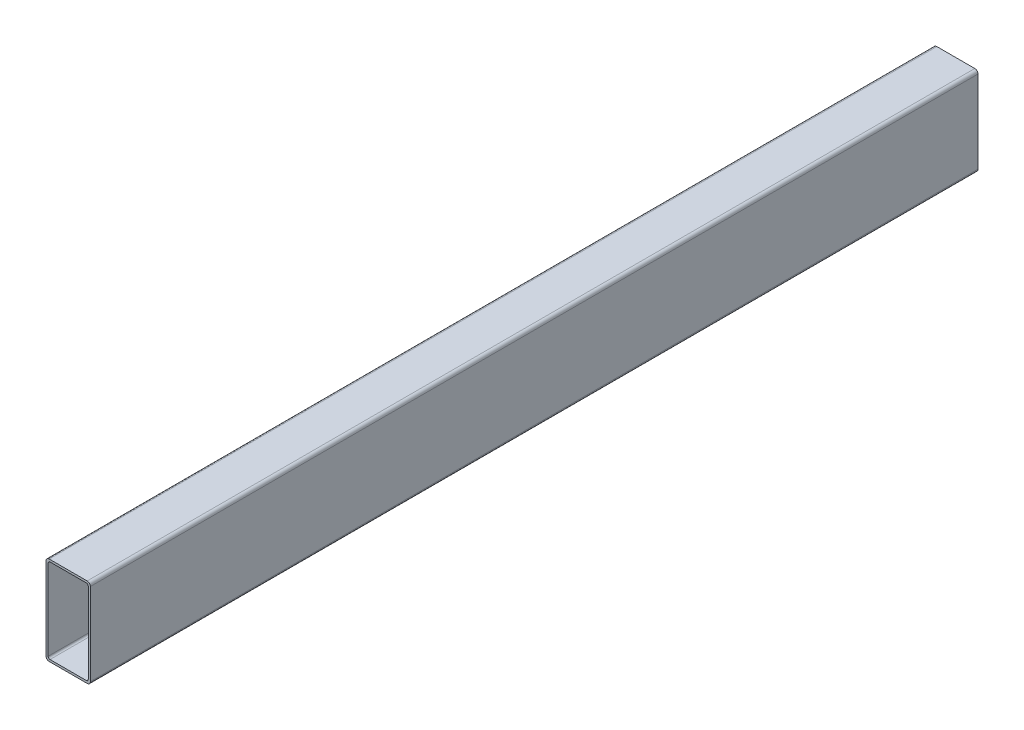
ISO-10303-21;
HEADER;
FILE_DESCRIPTION(('STEP AP214'),'2;1');
FILE_NAME('part.step','',(''),(''),'','','');
FILE_SCHEMA(('AUTOMOTIVE_DESIGN { 1 0 10303 214 1 1 1 1 }'));
ENDSEC;
DATA;
#1=APPLICATION_CONTEXT('core data for automotive mechanical design processes');
#2=APPLICATION_PROTOCOL_DEFINITION('international standard','automotive_design',2000,#1);
#3=PRODUCT_CONTEXT('',#1,'mechanical');
#4=PRODUCT('Part','Part','',(#3));
#5=PRODUCT_RELATED_PRODUCT_CATEGORY('part','',(#4));
#6=PRODUCT_DEFINITION_FORMATION('','',#4);
#7=PRODUCT_DEFINITION_CONTEXT('part definition',#1,'design');
#8=PRODUCT_DEFINITION('design','',#6,#7);
#9=PRODUCT_DEFINITION_SHAPE('','',#8);
#10=(LENGTH_UNIT() NAMED_UNIT(*) SI_UNIT(.MILLI.,.METRE.));
#11=(NAMED_UNIT(*) PLANE_ANGLE_UNIT() SI_UNIT($,.RADIAN.));
#12=(NAMED_UNIT(*) SI_UNIT($,.STERADIAN.) SOLID_ANGLE_UNIT());
#13=UNCERTAINTY_MEASURE_WITH_UNIT(LENGTH_MEASURE(1.E-05),#10,'distance_accuracy_value','');
#14=(GEOMETRIC_REPRESENTATION_CONTEXT(3) GLOBAL_UNCERTAINTY_ASSIGNED_CONTEXT((#13)) GLOBAL_UNIT_ASSIGNED_CONTEXT((#10,
#11,#12)) REPRESENTATION_CONTEXT('',''));
#15=CARTESIAN_POINT('',(0.,0.,0.));
#16=DIRECTION('',(0.,0.,1.));
#17=DIRECTION('',(1.,0.,0.));
#18=AXIS2_PLACEMENT_3D('',#15,#16,#17);
#19=CARTESIAN_POINT('',(10.704,23.204,500.));
#20=DIRECTION('',(0.,0.,-1.));
#21=DIRECTION('',(-1.,0.,0.));
#22=AXIS2_PLACEMENT_3D('',#19,#20,#21);
#23=PLANE('',#22);
#24=CARTESIAN_POINT('',(10.704,23.204,500.));
#25=DIRECTION('',(0.,0.,1.));
#26=DIRECTION('',(-1.,0.,0.));
#27=AXIS2_PLACEMENT_3D('',#24,#25,#26);
#28=CIRCLE('',#27,1.796);
#29=CARTESIAN_POINT('',(12.5,23.204,500.));
#30=VERTEX_POINT('',#29);
#31=CARTESIAN_POINT('',(10.704,25.,500.));
#32=VERTEX_POINT('',#31);
#33=EDGE_CURVE('E210',#30,#32,#28,.T.);
#34=ORIENTED_EDGE('',*,*,#33,.T.);
#35=DIRECTION('',(-1.,0.,0.));
#36=VECTOR('',#35,1.);
#37=CARTESIAN_POINT('',(-10.704,25.,500.));
#38=LINE('',#37,#36);
#39=CARTESIAN_POINT('',(-10.704,25.,500.));
#40=VERTEX_POINT('',#39);
#41=EDGE_CURVE('E213',#32,#40,#38,.T.);
#42=ORIENTED_EDGE('',*,*,#41,.T.);
#43=CARTESIAN_POINT('',(-10.704,23.204,500.));
#44=DIRECTION('',(0.,0.,1.));
#45=DIRECTION('',(1.,0.,0.));
#46=AXIS2_PLACEMENT_3D('',#43,#44,#45);
#47=CIRCLE('',#46,1.796);
#48=CARTESIAN_POINT('',(-12.5,23.204,500.));
#49=VERTEX_POINT('',#48);
#50=EDGE_CURVE('E216',#40,#49,#47,.T.);
#51=ORIENTED_EDGE('',*,*,#50,.T.);
#52=DIRECTION('',(0.,-1.,0.));
#53=VECTOR('',#52,1.);
#54=CARTESIAN_POINT('',(-12.5,23.204,500.));
#55=LINE('',#54,#53);
#56=CARTESIAN_POINT('',(-12.5,-23.204,500.));
#57=VERTEX_POINT('',#56);
#58=EDGE_CURVE('E218',#49,#57,#55,.T.);
#59=ORIENTED_EDGE('',*,*,#58,.T.);
#60=CARTESIAN_POINT('',(-10.704,-23.204,500.));
#61=DIRECTION('',(0.,0.,1.));
#62=DIRECTION('',(1.,0.,0.));
#63=AXIS2_PLACEMENT_3D('',#60,#61,#62);
#64=CIRCLE('',#63,1.796);
#65=CARTESIAN_POINT('',(-10.704,-25.,500.));
#66=VERTEX_POINT('',#65);
#67=EDGE_CURVE('E220',#57,#66,#64,.T.);
#68=ORIENTED_EDGE('',*,*,#67,.T.);
#69=DIRECTION('',(1.,0.,0.));
#70=VECTOR('',#69,1.);
#71=CARTESIAN_POINT('',(-10.704,-25.,500.));
#72=LINE('',#71,#70);
#73=CARTESIAN_POINT('',(10.704,-25.,500.));
#74=VERTEX_POINT('',#73);
#75=EDGE_CURVE('E222',#66,#74,#72,.T.);
#76=ORIENTED_EDGE('',*,*,#75,.T.);
#77=CARTESIAN_POINT('',(10.704,-23.204,500.));
#78=DIRECTION('',(0.,0.,1.));
#79=DIRECTION('',(1.,0.,0.));
#80=AXIS2_PLACEMENT_3D('',#77,#78,#79);
#81=CIRCLE('',#80,1.796);
#82=CARTESIAN_POINT('',(12.5,-23.204,500.));
#83=VERTEX_POINT('',#82);
#84=EDGE_CURVE('E224',#74,#83,#81,.T.);
#85=ORIENTED_EDGE('',*,*,#84,.T.);
#86=DIRECTION('',(0.,1.,0.));
#87=VECTOR('',#86,1.);
#88=CARTESIAN_POINT('',(12.5,23.204,500.));
#89=LINE('',#88,#87);
#90=EDGE_CURVE('E226',#83,#30,#89,.T.);
#91=ORIENTED_EDGE('',*,*,#90,.T.);
#92=EDGE_LOOP('',(#34,#42,#51,#59,#68,#76,#85,#91));
#93=FACE_BOUND('',#92,.T.);
#94=CARTESIAN_POINT('',(-10.252,22.752,500.));
#95=DIRECTION('',(0.,0.,1.));
#96=DIRECTION('',(1.,0.,0.));
#97=AXIS2_PLACEMENT_3D('',#94,#95,#96);
#98=CIRCLE('',#97,1.048);
#99=CARTESIAN_POINT('',(-10.252,23.8,500.));
#100=VERTEX_POINT('',#99);
#101=CARTESIAN_POINT('',(-11.3,22.752,500.));
#102=VERTEX_POINT('',#101);
#103=EDGE_CURVE('E145',#100,#102,#98,.T.);
#104=ORIENTED_EDGE('',*,*,#103,.F.);
#105=DIRECTION('',(-1.,0.,0.));
#106=VECTOR('',#105,1.);
#107=CARTESIAN_POINT('',(-10.252,23.8,500.));
#108=LINE('',#107,#106);
#109=CARTESIAN_POINT('',(10.252,23.8,500.));
#110=VERTEX_POINT('',#109);
#111=EDGE_CURVE('E178',#110,#100,#108,.T.);
#112=ORIENTED_EDGE('',*,*,#111,.F.);
#113=CARTESIAN_POINT('',(10.252,22.752,500.));
#114=DIRECTION('',(0.,0.,1.));
#115=DIRECTION('',(-1.,0.,0.));
#116=AXIS2_PLACEMENT_3D('',#113,#114,#115);
#117=CIRCLE('',#116,1.048);
#118=CARTESIAN_POINT('',(11.3,22.752,500.));
#119=VERTEX_POINT('',#118);
#120=EDGE_CURVE('E176',#119,#110,#117,.T.);
#121=ORIENTED_EDGE('',*,*,#120,.F.);
#122=DIRECTION('',(0.,1.,0.));
#123=VECTOR('',#122,1.);
#124=CARTESIAN_POINT('',(11.3,22.752,500.));
#125=LINE('',#124,#123);
#126=CARTESIAN_POINT('',(11.3,-22.752,500.));
#127=VERTEX_POINT('',#126);
#128=EDGE_CURVE('E174',#127,#119,#125,.T.);
#129=ORIENTED_EDGE('',*,*,#128,.F.);
#130=CARTESIAN_POINT('',(10.252,-22.752,500.));
#131=DIRECTION('',(0.,0.,1.));
#132=DIRECTION('',(1.,0.,0.));
#133=AXIS2_PLACEMENT_3D('',#130,#131,#132);
#134=CIRCLE('',#133,1.048);
#135=CARTESIAN_POINT('',(10.252,-23.8,500.));
#136=VERTEX_POINT('',#135);
#137=EDGE_CURVE('E172',#136,#127,#134,.T.);
#138=ORIENTED_EDGE('',*,*,#137,.F.);
#139=DIRECTION('',(1.,0.,0.));
#140=VECTOR('',#139,1.);
#141=CARTESIAN_POINT('',(-10.252,-23.8,500.));
#142=LINE('',#141,#140);
#143=CARTESIAN_POINT('',(-10.252,-23.8,500.));
#144=VERTEX_POINT('',#143);
#145=EDGE_CURVE('E168',#144,#136,#142,.T.);
#146=ORIENTED_EDGE('',*,*,#145,.F.);
#147=CARTESIAN_POINT('',(-10.252,-22.752,500.));
#148=DIRECTION('',(0.,0.,1.));
#149=DIRECTION('',(1.,0.,0.));
#150=AXIS2_PLACEMENT_3D('',#147,#148,#149);
#151=CIRCLE('',#150,1.048);
#152=CARTESIAN_POINT('',(-11.3,-22.752,500.));
#153=VERTEX_POINT('',#152);
#154=EDGE_CURVE('E166',#153,#144,#151,.T.);
#155=ORIENTED_EDGE('',*,*,#154,.F.);
#156=DIRECTION('',(0.,-1.,0.));
#157=VECTOR('',#156,1.);
#158=CARTESIAN_POINT('',(-11.3,22.752,500.));
#159=LINE('',#158,#157);
#160=EDGE_CURVE('E153',#102,#153,#159,.T.);
#161=ORIENTED_EDGE('',*,*,#160,.F.);
#162=EDGE_LOOP('',(#104,#112,#121,#129,#138,#146,#155,#161));
#163=FACE_BOUND('',#162,.T.);
#164=ADVANCED_FACE('F32',(#93,#163),#23,.F.);
#165=CARTESIAN_POINT('',(10.704,23.204,0.));
#166=DIRECTION('',(0.,0.,-1.));
#167=DIRECTION('',(-1.,0.,0.));
#168=AXIS2_PLACEMENT_3D('',#165,#166,#167);
#169=PLANE('',#168);
#170=CARTESIAN_POINT('',(10.704,23.204,0.));
#171=DIRECTION('',(0.,0.,1.));
#172=DIRECTION('',(-1.,0.,0.));
#173=AXIS2_PLACEMENT_3D('',#170,#171,#172);
#174=CIRCLE('',#173,1.796);
#175=CARTESIAN_POINT('',(12.5,23.204,0.));
#176=VERTEX_POINT('',#175);
#177=CARTESIAN_POINT('',(10.704,25.,0.));
#178=VERTEX_POINT('',#177);
#179=EDGE_CURVE('E161',#176,#178,#174,.T.);
#180=ORIENTED_EDGE('',*,*,#179,.F.);
#181=DIRECTION('',(0.,1.,0.));
#182=VECTOR('',#181,1.);
#183=CARTESIAN_POINT('',(12.5,23.204,0.));
#184=LINE('',#183,#182);
#185=CARTESIAN_POINT('',(12.5,-23.204,0.));
#186=VERTEX_POINT('',#185);
#187=EDGE_CURVE('E214',#186,#176,#184,.T.);
#188=ORIENTED_EDGE('',*,*,#187,.F.);
#189=CARTESIAN_POINT('',(10.704,-23.204,0.));
#190=DIRECTION('',(0.,0.,1.));
#191=DIRECTION('',(1.,0.,0.));
#192=AXIS2_PLACEMENT_3D('',#189,#190,#191);
#193=CIRCLE('',#192,1.796);
#194=CARTESIAN_POINT('',(10.704,-25.,0.));
#195=VERTEX_POINT('',#194);
#196=EDGE_CURVE('E241',#195,#186,#193,.T.);
#197=ORIENTED_EDGE('',*,*,#196,.F.);
#198=DIRECTION('',(1.,0.,0.));
#199=VECTOR('',#198,1.);
#200=CARTESIAN_POINT('',(-10.704,-25.,0.));
#201=LINE('',#200,#199);
#202=CARTESIAN_POINT('',(-10.704,-25.,0.));
#203=VERTEX_POINT('',#202);
#204=EDGE_CURVE('E239',#203,#195,#201,.T.);
#205=ORIENTED_EDGE('',*,*,#204,.F.);
#206=CARTESIAN_POINT('',(-10.704,-23.204,0.));
#207=DIRECTION('',(0.,0.,1.));
#208=DIRECTION('',(1.,0.,0.));
#209=AXIS2_PLACEMENT_3D('',#206,#207,#208);
#210=CIRCLE('',#209,1.796);
#211=CARTESIAN_POINT('',(-12.5,-23.204,0.));
#212=VERTEX_POINT('',#211);
#213=EDGE_CURVE('E237',#212,#203,#210,.T.);
#214=ORIENTED_EDGE('',*,*,#213,.F.);
#215=DIRECTION('',(0.,-1.,0.));
#216=VECTOR('',#215,1.);
#217=CARTESIAN_POINT('',(-12.5,23.204,0.));
#218=LINE('',#217,#216);
#219=CARTESIAN_POINT('',(-12.5,23.204,0.));
#220=VERTEX_POINT('',#219);
#221=EDGE_CURVE('E235',#220,#212,#218,.T.);
#222=ORIENTED_EDGE('',*,*,#221,.F.);
#223=CARTESIAN_POINT('',(-10.704,23.204,0.));
#224=DIRECTION('',(0.,0.,1.));
#225=DIRECTION('',(1.,0.,0.));
#226=AXIS2_PLACEMENT_3D('',#223,#224,#225);
#227=CIRCLE('',#226,1.796);
#228=CARTESIAN_POINT('',(-10.704,25.,0.));
#229=VERTEX_POINT('',#228);
#230=EDGE_CURVE('E233',#229,#220,#227,.T.);
#231=ORIENTED_EDGE('',*,*,#230,.F.);
#232=DIRECTION('',(-1.,0.,0.));
#233=VECTOR('',#232,1.);
#234=CARTESIAN_POINT('',(-10.704,25.,0.));
#235=LINE('',#234,#233);
#236=EDGE_CURVE('E231',#178,#229,#235,.T.);
#237=ORIENTED_EDGE('',*,*,#236,.F.);
#238=EDGE_LOOP('',(#180,#188,#197,#205,#214,#222,#231,#237));
#239=FACE_BOUND('',#238,.T.);
#240=DIRECTION('',(-1.,0.,0.));
#241=VECTOR('',#240,1.);
#242=CARTESIAN_POINT('',(-10.252,23.8,0.));
#243=LINE('',#242,#241);
#244=CARTESIAN_POINT('',(10.252,23.8,0.));
#245=VERTEX_POINT('',#244);
#246=CARTESIAN_POINT('',(-10.252,23.8,0.));
#247=VERTEX_POINT('',#246);
#248=EDGE_CURVE('E154',#245,#247,#243,.T.);
#249=ORIENTED_EDGE('',*,*,#248,.T.);
#250=CARTESIAN_POINT('',(-10.252,22.752,0.));
#251=DIRECTION('',(0.,0.,1.));
#252=DIRECTION('',(1.,0.,0.));
#253=AXIS2_PLACEMENT_3D('',#250,#251,#252);
#254=CIRCLE('',#253,1.048);
#255=CARTESIAN_POINT('',(-11.3,22.752,0.));
#256=VERTEX_POINT('',#255);
#257=EDGE_CURVE('E55',#247,#256,#254,.T.);
#258=ORIENTED_EDGE('',*,*,#257,.T.);
#259=DIRECTION('',(0.,-1.,0.));
#260=VECTOR('',#259,1.);
#261=CARTESIAN_POINT('',(-11.3,22.752,0.));
#262=LINE('',#261,#260);
#263=CARTESIAN_POINT('',(-11.3,-22.752,0.));
#264=VERTEX_POINT('',#263);
#265=EDGE_CURVE('E160',#256,#264,#262,.T.);
#266=ORIENTED_EDGE('',*,*,#265,.T.);
#267=CARTESIAN_POINT('',(-10.252,-22.752,0.));
#268=DIRECTION('',(0.,0.,1.));
#269=DIRECTION('',(1.,0.,0.));
#270=AXIS2_PLACEMENT_3D('',#267,#268,#269);
#271=CIRCLE('',#270,1.048);
#272=CARTESIAN_POINT('',(-10.252,-23.8,0.));
#273=VERTEX_POINT('',#272);
#274=EDGE_CURVE('E182',#264,#273,#271,.T.);
#275=ORIENTED_EDGE('',*,*,#274,.T.);
#276=DIRECTION('',(1.,0.,0.));
#277=VECTOR('',#276,1.);
#278=CARTESIAN_POINT('',(-10.252,-23.8,0.));
#279=LINE('',#278,#277);
#280=CARTESIAN_POINT('',(10.252,-23.8,0.));
#281=VERTEX_POINT('',#280);
#282=EDGE_CURVE('E185',#273,#281,#279,.T.);
#283=ORIENTED_EDGE('',*,*,#282,.T.);
#284=CARTESIAN_POINT('',(10.252,-22.752,0.));
#285=DIRECTION('',(0.,0.,1.));
#286=DIRECTION('',(1.,0.,0.));
#287=AXIS2_PLACEMENT_3D('',#284,#285,#286);
#288=CIRCLE('',#287,1.048);
#289=CARTESIAN_POINT('',(11.3,-22.752,0.));
#290=VERTEX_POINT('',#289);
#291=EDGE_CURVE('E188',#281,#290,#288,.T.);
#292=ORIENTED_EDGE('',*,*,#291,.T.);
#293=DIRECTION('',(0.,1.,0.));
#294=VECTOR('',#293,1.);
#295=CARTESIAN_POINT('',(11.3,22.752,0.));
#296=LINE('',#295,#294);
#297=CARTESIAN_POINT('',(11.3,22.752,0.));
#298=VERTEX_POINT('',#297);
#299=EDGE_CURVE('E191',#290,#298,#296,.T.);
#300=ORIENTED_EDGE('',*,*,#299,.T.);
#301=CARTESIAN_POINT('',(10.252,22.752,0.));
#302=DIRECTION('',(0.,0.,1.));
#303=DIRECTION('',(-1.,0.,0.));
#304=AXIS2_PLACEMENT_3D('',#301,#302,#303);
#305=CIRCLE('',#304,1.048);
#306=EDGE_CURVE('E194',#298,#245,#305,.T.);
#307=ORIENTED_EDGE('',*,*,#306,.T.);
#308=EDGE_LOOP('',(#249,#258,#266,#275,#283,#292,#300,#307));
#309=FACE_BOUND('',#308,.T.);
#310=ADVANCED_FACE('F271',(#239,#309),#169,.T.);
#311=CARTESIAN_POINT('',(10.704,23.204,500.));
#312=DIRECTION('',(0.,0.,-1.));
#313=DIRECTION('',(-1.,0.,0.));
#314=AXIS2_PLACEMENT_3D('',#311,#312,#313);
#315=CYLINDRICAL_SURFACE('',#314,1.796);
#316=ORIENTED_EDGE('',*,*,#179,.T.);
#317=DIRECTION('',(0.,0.,-1.));
#318=VECTOR('',#317,1.);
#319=CARTESIAN_POINT('',(10.704,25.,500.));
#320=LINE('',#319,#318);
#321=EDGE_CURVE('E11',#32,#178,#320,.T.);
#322=ORIENTED_EDGE('',*,*,#321,.F.);
#323=ORIENTED_EDGE('',*,*,#33,.F.);
#324=DIRECTION('',(0.,0.,-1.));
#325=VECTOR('',#324,1.);
#326=CARTESIAN_POINT('',(12.5,23.204,500.));
#327=LINE('',#326,#325);
#328=EDGE_CURVE('E228',#30,#176,#327,.T.);
#329=ORIENTED_EDGE('',*,*,#328,.T.);
#330=EDGE_LOOP('',(#316,#322,#323,#329));
#331=FACE_BOUND('',#330,.T.);
#332=ADVANCED_FACE('F34',(#331),#315,.T.);
#333=CARTESIAN_POINT('',(-10.704,25.,500.));
#334=DIRECTION('',(0.,-1.,0.));
#335=DIRECTION('',(0.,0.,-1.));
#336=AXIS2_PLACEMENT_3D('',#333,#334,#335);
#337=PLANE('',#336);
#338=ORIENTED_EDGE('',*,*,#236,.T.);
#339=DIRECTION('',(0.,0.,-1.));
#340=VECTOR('',#339,1.);
#341=CARTESIAN_POINT('',(-10.704,25.,500.));
#342=LINE('',#341,#340);
#343=EDGE_CURVE('E40',#40,#229,#342,.T.);
#344=ORIENTED_EDGE('',*,*,#343,.F.);
#345=ORIENTED_EDGE('',*,*,#41,.F.);
#346=ORIENTED_EDGE('',*,*,#321,.T.);
#347=EDGE_LOOP('',(#338,#344,#345,#346));
#348=FACE_BOUND('',#347,.T.);
#349=ADVANCED_FACE('F288',(#348),#337,.F.);
#350=CARTESIAN_POINT('',(-10.704,23.204,500.));
#351=DIRECTION('',(0.,0.,-1.));
#352=DIRECTION('',(-1.,0.,0.));
#353=AXIS2_PLACEMENT_3D('',#350,#351,#352);
#354=CYLINDRICAL_SURFACE('',#353,1.796);
#355=ORIENTED_EDGE('',*,*,#230,.T.);
#356=DIRECTION('',(0.,0.,-1.));
#357=VECTOR('',#356,1.);
#358=CARTESIAN_POINT('',(-12.5,23.204,500.));
#359=LINE('',#358,#357);
#360=EDGE_CURVE('E258',#49,#220,#359,.T.);
#361=ORIENTED_EDGE('',*,*,#360,.F.);
#362=ORIENTED_EDGE('',*,*,#50,.F.);
#363=ORIENTED_EDGE('',*,*,#343,.T.);
#364=EDGE_LOOP('',(#355,#361,#362,#363));
#365=FACE_BOUND('',#364,.T.);
#366=ADVANCED_FACE('F265',(#365),#354,.T.);
#367=CARTESIAN_POINT('',(-12.5,23.204,500.));
#368=DIRECTION('',(1.,0.,0.));
#369=DIRECTION('',(0.,0.,-1.));
#370=AXIS2_PLACEMENT_3D('',#367,#368,#369);
#371=PLANE('',#370);
#372=ORIENTED_EDGE('',*,*,#221,.T.);
#373=DIRECTION('',(0.,0.,-1.));
#374=VECTOR('',#373,1.);
#375=CARTESIAN_POINT('',(-12.5,-23.204,500.));
#376=LINE('',#375,#374);
#377=EDGE_CURVE('E255',#57,#212,#376,.T.);
#378=ORIENTED_EDGE('',*,*,#377,.F.);
#379=ORIENTED_EDGE('',*,*,#58,.F.);
#380=ORIENTED_EDGE('',*,*,#360,.T.);
#381=EDGE_LOOP('',(#372,#378,#379,#380));
#382=FACE_BOUND('',#381,.T.);
#383=ADVANCED_FACE('F277',(#382),#371,.F.);
#384=CARTESIAN_POINT('',(-10.704,-23.204,500.));
#385=DIRECTION('',(0.,0.,-1.));
#386=DIRECTION('',(-1.,0.,0.));
#387=AXIS2_PLACEMENT_3D('',#384,#385,#386);
#388=CYLINDRICAL_SURFACE('',#387,1.796);
#389=ORIENTED_EDGE('',*,*,#213,.T.);
#390=DIRECTION('',(0.,0.,-1.));
#391=VECTOR('',#390,1.);
#392=CARTESIAN_POINT('',(-10.704,-25.,500.));
#393=LINE('',#392,#391);
#394=EDGE_CURVE('E252',#66,#203,#393,.T.);
#395=ORIENTED_EDGE('',*,*,#394,.F.);
#396=ORIENTED_EDGE('',*,*,#67,.F.);
#397=ORIENTED_EDGE('',*,*,#377,.T.);
#398=EDGE_LOOP('',(#389,#395,#396,#397));
#399=FACE_BOUND('',#398,.T.);
#400=ADVANCED_FACE('F281',(#399),#388,.T.);
#401=CARTESIAN_POINT('',(-10.704,-25.,500.));
#402=DIRECTION('',(0.,1.,0.));
#403=DIRECTION('',(0.,0.,1.));
#404=AXIS2_PLACEMENT_3D('',#401,#402,#403);
#405=PLANE('',#404);
#406=ORIENTED_EDGE('',*,*,#204,.T.);
#407=DIRECTION('',(0.,0.,-1.));
#408=VECTOR('',#407,1.);
#409=CARTESIAN_POINT('',(10.704,-25.,500.));
#410=LINE('',#409,#408);
#411=EDGE_CURVE('E249',#74,#195,#410,.T.);
#412=ORIENTED_EDGE('',*,*,#411,.F.);
#413=ORIENTED_EDGE('',*,*,#75,.F.);
#414=ORIENTED_EDGE('',*,*,#394,.T.);
#415=EDGE_LOOP('',(#406,#412,#413,#414));
#416=FACE_BOUND('',#415,.T.);
#417=ADVANCED_FACE('F301',(#416),#405,.F.);
#418=CARTESIAN_POINT('',(10.704,-23.204,500.));
#419=DIRECTION('',(0.,0.,-1.));
#420=DIRECTION('',(-1.,0.,0.));
#421=AXIS2_PLACEMENT_3D('',#418,#419,#420);
#422=CYLINDRICAL_SURFACE('',#421,1.796);
#423=ORIENTED_EDGE('',*,*,#196,.T.);
#424=DIRECTION('',(0.,0.,-1.));
#425=VECTOR('',#424,1.);
#426=CARTESIAN_POINT('',(12.5,-23.204,500.));
#427=LINE('',#426,#425);
#428=EDGE_CURVE('E246',#83,#186,#427,.T.);
#429=ORIENTED_EDGE('',*,*,#428,.F.);
#430=ORIENTED_EDGE('',*,*,#84,.F.);
#431=ORIENTED_EDGE('',*,*,#411,.T.);
#432=EDGE_LOOP('',(#423,#429,#430,#431));
#433=FACE_BOUND('',#432,.T.);
#434=ADVANCED_FACE('F299',(#433),#422,.T.);
#435=CARTESIAN_POINT('',(12.5,23.204,500.));
#436=DIRECTION('',(-1.,0.,0.));
#437=DIRECTION('',(0.,0.,1.));
#438=AXIS2_PLACEMENT_3D('',#435,#436,#437);
#439=PLANE('',#438);
#440=ORIENTED_EDGE('',*,*,#187,.T.);
#441=ORIENTED_EDGE('',*,*,#328,.F.);
#442=ORIENTED_EDGE('',*,*,#90,.F.);
#443=ORIENTED_EDGE('',*,*,#428,.T.);
#444=EDGE_LOOP('',(#440,#441,#442,#443));
#445=FACE_BOUND('',#444,.T.);
#446=ADVANCED_FACE('F294',(#445),#439,.F.);
#447=CARTESIAN_POINT('',(-10.252,22.752,500.));
#448=DIRECTION('',(0.,0.,-1.));
#449=DIRECTION('',(-1.,0.,0.));
#450=AXIS2_PLACEMENT_3D('',#447,#448,#449);
#451=CYLINDRICAL_SURFACE('',#450,1.048);
#452=ORIENTED_EDGE('',*,*,#257,.F.);
#453=DIRECTION('',(0.,0.,-1.));
#454=VECTOR('',#453,1.);
#455=CARTESIAN_POINT('',(-10.252,23.8,500.));
#456=LINE('',#455,#454);
#457=EDGE_CURVE('E149',#100,#247,#456,.T.);
#458=ORIENTED_EDGE('',*,*,#457,.F.);
#459=ORIENTED_EDGE('',*,*,#103,.T.);
#460=DIRECTION('',(0.,0.,-1.));
#461=VECTOR('',#460,1.);
#462=CARTESIAN_POINT('',(-11.3,22.752,500.));
#463=LINE('',#462,#461);
#464=EDGE_CURVE('E148',#102,#256,#463,.T.);
#465=ORIENTED_EDGE('',*,*,#464,.T.);
#466=EDGE_LOOP('',(#452,#458,#459,#465));
#467=FACE_BOUND('',#466,.T.);
#468=ADVANCED_FACE('F147',(#467),#451,.F.);
#469=CARTESIAN_POINT('',(-11.3,22.752,500.));
#470=DIRECTION('',(1.,0.,0.));
#471=DIRECTION('',(0.,0.,-1.));
#472=AXIS2_PLACEMENT_3D('',#469,#470,#471);
#473=PLANE('',#472);
#474=ORIENTED_EDGE('',*,*,#265,.F.);
#475=ORIENTED_EDGE('',*,*,#464,.F.);
#476=ORIENTED_EDGE('',*,*,#160,.T.);
#477=DIRECTION('',(0.,0.,-1.));
#478=VECTOR('',#477,1.);
#479=CARTESIAN_POINT('',(-11.3,-22.752,500.));
#480=LINE('',#479,#478);
#481=EDGE_CURVE('E162',#153,#264,#480,.T.);
#482=ORIENTED_EDGE('',*,*,#481,.T.);
#483=EDGE_LOOP('',(#474,#475,#476,#482));
#484=FACE_BOUND('',#483,.T.);
#485=ADVANCED_FACE('F157',(#484),#473,.T.);
#486=CARTESIAN_POINT('',(-10.252,-22.752,500.));
#487=DIRECTION('',(0.,0.,-1.));
#488=DIRECTION('',(-1.,0.,0.));
#489=AXIS2_PLACEMENT_3D('',#486,#487,#488);
#490=CYLINDRICAL_SURFACE('',#489,1.048);
#491=ORIENTED_EDGE('',*,*,#274,.F.);
#492=ORIENTED_EDGE('',*,*,#481,.F.);
#493=ORIENTED_EDGE('',*,*,#154,.T.);
#494=DIRECTION('',(0.,0.,-1.));
#495=VECTOR('',#494,1.);
#496=CARTESIAN_POINT('',(-10.252,-23.8,500.));
#497=LINE('',#496,#495);
#498=EDGE_CURVE('E207',#144,#273,#497,.T.);
#499=ORIENTED_EDGE('',*,*,#498,.T.);
#500=EDGE_LOOP('',(#491,#492,#493,#499));
#501=FACE_BOUND('',#500,.T.);
#502=ADVANCED_FACE('F326',(#501),#490,.F.);
#503=CARTESIAN_POINT('',(-10.252,-23.8,500.));
#504=DIRECTION('',(0.,1.,0.));
#505=DIRECTION('',(-1.,0.,0.));
#506=AXIS2_PLACEMENT_3D('',#503,#504,#505);
#507=PLANE('',#506);
#508=ORIENTED_EDGE('',*,*,#282,.F.);
#509=ORIENTED_EDGE('',*,*,#498,.F.);
#510=ORIENTED_EDGE('',*,*,#145,.T.);
#511=DIRECTION('',(0.,0.,-1.));
#512=VECTOR('',#511,1.);
#513=CARTESIAN_POINT('',(10.252,-23.8,500.));
#514=LINE('',#513,#512);
#515=EDGE_CURVE('E205',#136,#281,#514,.T.);
#516=ORIENTED_EDGE('',*,*,#515,.T.);
#517=EDGE_LOOP('',(#508,#509,#510,#516));
#518=FACE_BOUND('',#517,.T.);
#519=ADVANCED_FACE('F330',(#518),#507,.T.);
#520=CARTESIAN_POINT('',(10.252,-22.752,500.));
#521=DIRECTION('',(0.,0.,-1.));
#522=DIRECTION('',(-1.,0.,0.));
#523=AXIS2_PLACEMENT_3D('',#520,#521,#522);
#524=CYLINDRICAL_SURFACE('',#523,1.048);
#525=ORIENTED_EDGE('',*,*,#291,.F.);
#526=ORIENTED_EDGE('',*,*,#515,.F.);
#527=ORIENTED_EDGE('',*,*,#137,.T.);
#528=DIRECTION('',(0.,0.,-1.));
#529=VECTOR('',#528,1.);
#530=CARTESIAN_POINT('',(11.3,-22.752,500.));
#531=LINE('',#530,#529);
#532=EDGE_CURVE('E203',#127,#290,#531,.T.);
#533=ORIENTED_EDGE('',*,*,#532,.T.);
#534=EDGE_LOOP('',(#525,#526,#527,#533));
#535=FACE_BOUND('',#534,.T.);
#536=ADVANCED_FACE('F336',(#535),#524,.F.);
#537=CARTESIAN_POINT('',(11.3,22.752,500.));
#538=DIRECTION('',(-1.,0.,0.));
#539=DIRECTION('',(0.,0.,1.));
#540=AXIS2_PLACEMENT_3D('',#537,#538,#539);
#541=PLANE('',#540);
#542=ORIENTED_EDGE('',*,*,#299,.F.);
#543=ORIENTED_EDGE('',*,*,#532,.F.);
#544=ORIENTED_EDGE('',*,*,#128,.T.);
#545=DIRECTION('',(0.,0.,-1.));
#546=VECTOR('',#545,1.);
#547=CARTESIAN_POINT('',(11.3,22.752,500.));
#548=LINE('',#547,#546);
#549=EDGE_CURVE('E201',#119,#298,#548,.T.);
#550=ORIENTED_EDGE('',*,*,#549,.T.);
#551=EDGE_LOOP('',(#542,#543,#544,#550));
#552=FACE_BOUND('',#551,.T.);
#553=ADVANCED_FACE('F340',(#552),#541,.T.);
#554=CARTESIAN_POINT('',(10.252,22.752,500.));
#555=DIRECTION('',(0.,0.,-1.));
#556=DIRECTION('',(-1.,0.,0.));
#557=AXIS2_PLACEMENT_3D('',#554,#555,#556);
#558=CYLINDRICAL_SURFACE('',#557,1.048);
#559=ORIENTED_EDGE('',*,*,#306,.F.);
#560=ORIENTED_EDGE('',*,*,#549,.F.);
#561=ORIENTED_EDGE('',*,*,#120,.T.);
#562=DIRECTION('',(0.,0.,-1.));
#563=VECTOR('',#562,1.);
#564=CARTESIAN_POINT('',(10.252,23.8,500.));
#565=LINE('',#564,#563);
#566=EDGE_CURVE('E47',#110,#245,#565,.T.);
#567=ORIENTED_EDGE('',*,*,#566,.T.);
#568=EDGE_LOOP('',(#559,#560,#561,#567));
#569=FACE_BOUND('',#568,.T.);
#570=ADVANCED_FACE('F344',(#569),#558,.F.);
#571=CARTESIAN_POINT('',(-10.252,23.8,500.));
#572=DIRECTION('',(0.,-1.,0.));
#573=DIRECTION('',(0.,0.,-1.));
#574=AXIS2_PLACEMENT_3D('',#571,#572,#573);
#575=PLANE('',#574);
#576=ORIENTED_EDGE('',*,*,#248,.F.);
#577=ORIENTED_EDGE('',*,*,#566,.F.);
#578=ORIENTED_EDGE('',*,*,#111,.T.);
#579=ORIENTED_EDGE('',*,*,#457,.T.);
#580=EDGE_LOOP('',(#576,#577,#578,#579));
#581=FACE_BOUND('',#580,.T.);
#582=ADVANCED_FACE('F348',(#581),#575,.T.);
#583=CLOSED_SHELL('',(#164,#310,#332,#349,#366,#383,#400,#417,#434,#446,#468,#485,#502,#519,
#536,#553,#570,#582));
#584=MANIFOLD_SOLID_BREP('B2',#583);
#585=ADVANCED_BREP_SHAPE_REPRESENTATION('',(#18,#584),#14);
#586=SHAPE_DEFINITION_REPRESENTATION(#9,#585);
ENDSEC;
END-ISO-10303-21;
